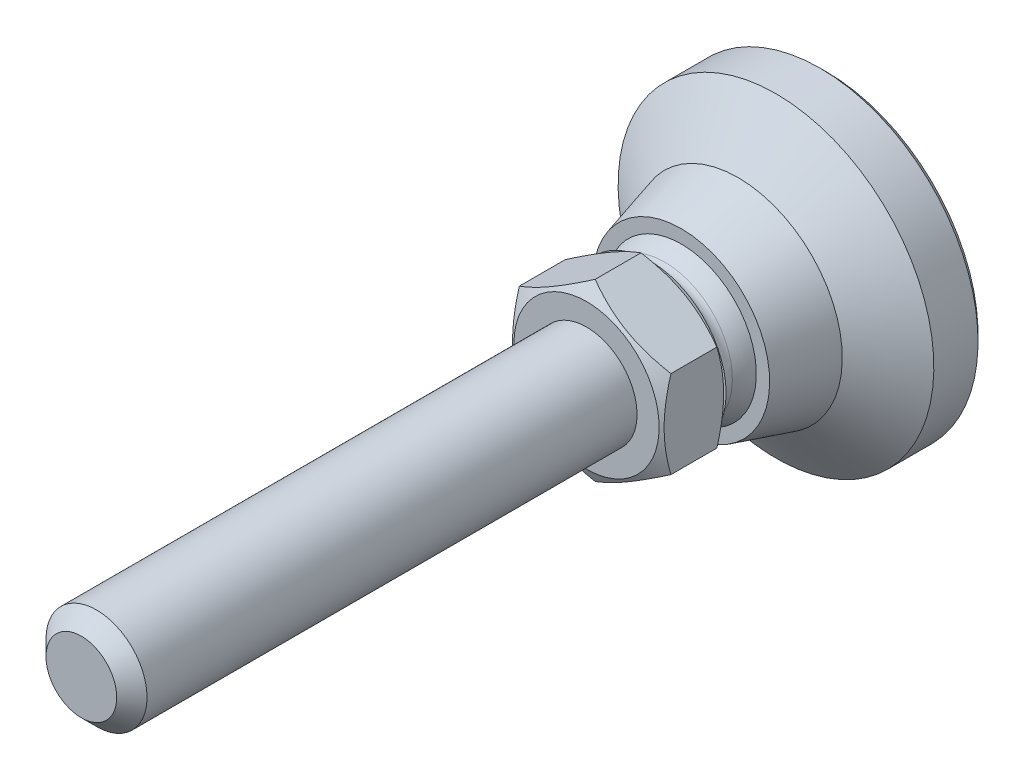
ISO-10303-21;
HEADER;
FILE_DESCRIPTION(('STEP AP214'),'2;1');
FILE_NAME('part.step','',(''),(''),'','','');
FILE_SCHEMA(('AUTOMOTIVE_DESIGN { 1 0 10303 214 1 1 1 1 }'));
ENDSEC;
DATA;
#1=APPLICATION_CONTEXT('core data for automotive mechanical design processes');
#2=APPLICATION_PROTOCOL_DEFINITION('international standard','automotive_design',2000,#1);
#3=PRODUCT_CONTEXT('',#1,'mechanical');
#4=PRODUCT('Part','Part','',(#3));
#5=PRODUCT_RELATED_PRODUCT_CATEGORY('part','',(#4));
#6=PRODUCT_DEFINITION_FORMATION('','',#4);
#7=PRODUCT_DEFINITION_CONTEXT('part definition',#1,'design');
#8=PRODUCT_DEFINITION('design','',#6,#7);
#9=PRODUCT_DEFINITION_SHAPE('','',#8);
#10=(LENGTH_UNIT() NAMED_UNIT(*) SI_UNIT(.MILLI.,.METRE.));
#11=(NAMED_UNIT(*) PLANE_ANGLE_UNIT() SI_UNIT($,.RADIAN.));
#12=(NAMED_UNIT(*) SI_UNIT($,.STERADIAN.) SOLID_ANGLE_UNIT());
#13=UNCERTAINTY_MEASURE_WITH_UNIT(LENGTH_MEASURE(1.E-05),#10,'distance_accuracy_value','');
#14=(GEOMETRIC_REPRESENTATION_CONTEXT(3) GLOBAL_UNCERTAINTY_ASSIGNED_CONTEXT((#13)) GLOBAL_UNIT_ASSIGNED_CONTEXT((#10,
#11,#12)) REPRESENTATION_CONTEXT('',''));
#15=CARTESIAN_POINT('',(0.,0.,0.));
#16=DIRECTION('',(0.,0.,1.));
#17=DIRECTION('',(1.,0.,0.));
#18=AXIS2_PLACEMENT_3D('',#15,#16,#17);
#19=CARTESIAN_POINT('',(0.,0.,13.1997727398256));
#20=DIRECTION('',(0.,0.,-1.));
#21=DIRECTION('',(0.,1.,0.));
#22=AXIS2_PLACEMENT_3D('',#19,#20,#21);
#23=TOROIDAL_SURFACE('',#22,6.05010447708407,0.800227);
#24=CARTESIAN_POINT('',(0.,0.,12.8053527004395));
#25=DIRECTION('',(0.,0.,-1.));
#26=DIRECTION('',(0.,1.,0.));
#27=AXIS2_PLACEMENT_3D('',#24,#25,#26);
#28=CIRCLE('',#27,5.35383148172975);
#29=CARTESIAN_POINT('',(-5.35383148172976,0.,12.8053527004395));
#30=VERTEX_POINT('',#29);
#31=EDGE_CURVE('E163',#30,#30,#28,.T.);
#32=ORIENTED_EDGE('',*,*,#31,.F.);
#33=EDGE_LOOP('',(#32));
#34=FACE_BOUND('',#33,.T.);
#35=CARTESIAN_POINT('',(2.32741435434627,5.58440951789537,13.999999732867));
#36=CARTESIAN_POINT('',(2.3873164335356,5.55944454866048,13.999999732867));
#37=CARTESIAN_POINT('',(2.44681650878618,5.53351506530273,13.999999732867));
#38=CARTESIAN_POINT('',(2.56495174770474,5.47975547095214,13.999999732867));
#39=CARTESIAN_POINT('',(2.62358691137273,5.45192535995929,13.999999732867));
#40=CARTESIAN_POINT('',(2.73993142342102,5.39439291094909,13.999999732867));
#41=CARTESIAN_POINT('',(2.79764077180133,5.36469057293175,13.999999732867));
#42=CARTESIAN_POINT('',(2.91207394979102,5.30344453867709,13.999999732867));
#43=CARTESIAN_POINT('',(2.96879777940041,5.27190084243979,13.999999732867));
#44=CARTESIAN_POINT('',(3.08120116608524,5.20700471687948,13.999999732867));
#45=CARTESIAN_POINT('',(3.1368807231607,5.17365228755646,13.999999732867));
#46=CARTESIAN_POINT('',(3.24713793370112,5.10517326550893,13.999999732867));
#47=CARTESIAN_POINT('',(3.30171558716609,5.07004667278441,13.999999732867));
#48=CARTESIAN_POINT('',(3.409712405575,4.99805559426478,13.999999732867));
#49=CARTESIAN_POINT('',(3.46313157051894,4.96119110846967,13.999999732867));
#50=CARTESIAN_POINT('',(3.56875636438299,4.88576278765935,13.999999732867));
#51=CARTESIAN_POINT('',(3.62096199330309,4.84719895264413,13.999999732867));
#52=CARTESIAN_POINT('',(3.67253333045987,4.80780471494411,13.999999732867));
#53=B_SPLINE_CURVE_WITH_KNOTS('',3,(#35,#36,#37,#38,#39,#40,#41,#42,#43,#44,#45,#46,#47,#48,#49,
#50,#51,#52),.UNSPECIFIED.,.F.,.F.,(4,2,2,2,2,2,2,2,4),(0.,0.194679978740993,0.389359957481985,
0.584039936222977,0.778719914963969,0.973399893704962,1.16807987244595,1.36275985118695,
1.55743982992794),.UNSPECIFIED.);
#54=CARTESIAN_POINT('',(2.32725304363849,5.58454795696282,13.9999997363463));
#55=VERTEX_POINT('',#54);
#56=CARTESIAN_POINT('',(3.67273387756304,4.807734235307,13.9999997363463));
#57=VERTEX_POINT('',#56);
#58=EDGE_CURVE('E109',#55,#57,#53,.T.);
#59=ORIENTED_EDGE('',*,*,#58,.T.);
#60=CARTESIAN_POINT('',(0.,0.,13.999999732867));
#61=DIRECTION('',(0.,0.,-1.));
#62=DIRECTION('',(0.,1.,0.));
#63=AXIS2_PLACEMENT_3D('',#60,#61,#62);
#64=CIRCLE('',#63,6.04999894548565);
#65=CARTESIAN_POINT('',(5.99998692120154,0.776813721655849,13.9999997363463));
#66=VERTEX_POINT('',#65);
#67=EDGE_CURVE('E169',#57,#66,#64,.T.);
#68=ORIENTED_EDGE('',*,*,#67,.T.);
#69=CARTESIAN_POINT('',(5.99994768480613,0.776604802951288,13.999999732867));
#70=CARTESIAN_POINT('',(6.00827842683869,0.712245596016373,13.999999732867));
#71=CARTESIAN_POINT('',(6.01557287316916,0.647752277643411,13.999999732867));
#72=CARTESIAN_POINT('',(6.02808331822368,0.518564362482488,13.999999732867));
#73=CARTESIAN_POINT('',(6.03329931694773,0.453869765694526,13.999999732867));
#74=CARTESIAN_POINT('',(6.04164701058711,0.324346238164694,13.999999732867));
#75=CARTESIAN_POINT('',(6.04477870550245,0.259517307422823,13.999999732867));
#76=CARTESIAN_POINT('',(6.04895467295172,0.129792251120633,13.999999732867));
#77=CARTESIAN_POINT('',(6.04999894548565,0.0648961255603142,13.999999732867));
#78=CARTESIAN_POINT('',(6.04999894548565,-0.0648961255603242,13.999999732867));
#79=CARTESIAN_POINT('',(6.04895467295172,-0.129792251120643,13.999999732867));
#80=CARTESIAN_POINT('',(6.04477870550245,-0.259517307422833,13.999999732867));
#81=CARTESIAN_POINT('',(6.04164701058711,-0.324346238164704,13.999999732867));
#82=CARTESIAN_POINT('',(6.03329931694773,-0.453869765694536,13.999999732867));
#83=CARTESIAN_POINT('',(6.02808331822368,-0.518564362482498,13.999999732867));
#84=CARTESIAN_POINT('',(6.01557287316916,-0.647752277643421,13.999999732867));
#85=CARTESIAN_POINT('',(6.00827842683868,-0.712245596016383,13.999999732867));
#86=CARTESIAN_POINT('',(5.99994768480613,-0.776604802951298,13.999999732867));
#87=B_SPLINE_CURVE_WITH_KNOTS('',3,(#69,#70,#71,#72,#73,#74,#75,#76,#77,#78,#79,#80,#81,#82,#83,
#84,#85,#86),.UNSPECIFIED.,.F.,.F.,(4,2,2,2,2,2,2,2,4),(0.,0.194679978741,0.389359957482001,
0.584039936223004,0.778719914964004,0.973399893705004,1.16807987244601,1.36275985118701,
1.55743982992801),.UNSPECIFIED.);
#88=CARTESIAN_POINT('',(5.99998692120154,-0.776813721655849,13.9999997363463));
#89=VERTEX_POINT('',#88);
#90=EDGE_CURVE('E615',#66,#89,#87,.T.);
#91=ORIENTED_EDGE('',*,*,#90,.T.);
#92=CARTESIAN_POINT('',(3.67273387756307,-4.80773423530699,13.9999997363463));
#93=VERTEX_POINT('',#92);
#94=EDGE_CURVE('E179',#89,#93,#64,.T.);
#95=ORIENTED_EDGE('',*,*,#94,.T.);
#96=CARTESIAN_POINT('',(3.67253333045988,-4.8078047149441,13.999999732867));
#97=CARTESIAN_POINT('',(3.6209619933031,-4.84719895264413,13.999999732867));
#98=CARTESIAN_POINT('',(3.56875636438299,-4.88576278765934,13.999999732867));
#99=CARTESIAN_POINT('',(3.46313157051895,-4.96119110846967,13.999999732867));
#100=CARTESIAN_POINT('',(3.40971240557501,-4.99805559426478,13.999999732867));
#101=CARTESIAN_POINT('',(3.30171558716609,-5.07004667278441,13.999999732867));
#102=CARTESIAN_POINT('',(3.24713793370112,-5.10517326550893,13.999999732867));
#103=CARTESIAN_POINT('',(3.13688072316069,-5.17365228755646,13.999999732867));
#104=CARTESIAN_POINT('',(3.08120116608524,-5.20700471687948,13.999999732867));
#105=CARTESIAN_POINT('',(2.9687977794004,-5.2719008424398,13.999999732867));
#106=CARTESIAN_POINT('',(2.91207394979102,-5.3034445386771,13.999999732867));
#107=CARTESIAN_POINT('',(2.79764077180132,-5.36469057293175,13.999999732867));
#108=CARTESIAN_POINT('',(2.73993142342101,-5.3943929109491,13.999999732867));
#109=CARTESIAN_POINT('',(2.62358691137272,-5.4519253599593,13.999999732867));
#110=CARTESIAN_POINT('',(2.56495174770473,-5.47975547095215,13.999999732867));
#111=CARTESIAN_POINT('',(2.44681650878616,-5.53351506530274,13.999999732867));
#112=CARTESIAN_POINT('',(2.38731643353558,-5.55944454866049,13.999999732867));
#113=CARTESIAN_POINT('',(2.32741435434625,-5.58440951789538,13.999999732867));
#114=B_SPLINE_CURVE_WITH_KNOTS('',3,(#96,#97,#98,#99,#100,#101,#102,#103,#104,#105,#106,#107,
#108,#109,#110,#111,#112,#113),.UNSPECIFIED.,.F.,.F.,(4,2,2,2,2,2,2,2,4),(0.,0.194679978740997,
0.389359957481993,0.584039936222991,0.778719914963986,0.973399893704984,1.16807987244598,
1.36275985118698,1.55743982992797),.UNSPECIFIED.);
#115=CARTESIAN_POINT('',(2.32725304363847,-5.58454795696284,13.9999997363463));
#116=VERTEX_POINT('',#115);
#117=EDGE_CURVE('E262',#93,#116,#114,.T.);
#118=ORIENTED_EDGE('',*,*,#117,.T.);
#119=CARTESIAN_POINT('',(-2.32725304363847,-5.58454795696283,13.9999997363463));
#120=VERTEX_POINT('',#119);
#121=EDGE_CURVE('E181',#116,#120,#64,.T.);
#122=ORIENTED_EDGE('',*,*,#121,.T.);
#123=CARTESIAN_POINT('',(-2.32741435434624,-5.58440951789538,13.999999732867));
#124=CARTESIAN_POINT('',(-2.38731643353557,-5.55944454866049,13.999999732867));
#125=CARTESIAN_POINT('',(-2.44681650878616,-5.53351506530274,13.999999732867));
#126=CARTESIAN_POINT('',(-2.56495174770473,-5.47975547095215,13.999999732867));
#127=CARTESIAN_POINT('',(-2.62358691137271,-5.4519253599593,13.999999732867));
#128=CARTESIAN_POINT('',(-2.73993142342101,-5.3943929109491,13.999999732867));
#129=CARTESIAN_POINT('',(-2.79764077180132,-5.36469057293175,13.999999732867));
#130=CARTESIAN_POINT('',(-2.91207394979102,-5.3034445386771,13.999999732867));
#131=CARTESIAN_POINT('',(-2.9687977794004,-5.2719008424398,13.999999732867));
#132=CARTESIAN_POINT('',(-3.08120116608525,-5.20700471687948,13.999999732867));
#133=CARTESIAN_POINT('',(-3.1368807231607,-5.17365228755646,13.999999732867));
#134=CARTESIAN_POINT('',(-3.24713793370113,-5.10517326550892,13.999999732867));
#135=CARTESIAN_POINT('',(-3.3017155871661,-5.0700466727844,13.999999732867));
#136=CARTESIAN_POINT('',(-3.40971240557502,-4.99805559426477,13.999999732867));
#137=CARTESIAN_POINT('',(-3.46313157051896,-4.96119110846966,13.999999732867));
#138=CARTESIAN_POINT('',(-3.56875636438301,-4.88576278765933,13.999999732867));
#139=CARTESIAN_POINT('',(-3.62096199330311,-4.84719895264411,13.999999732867));
#140=CARTESIAN_POINT('',(-3.67253333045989,-4.80780471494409,13.999999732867));
#141=B_SPLINE_CURVE_WITH_KNOTS('',3,(#123,#124,#125,#126,#127,#128,#129,#130,#131,#132,#133,
#134,#135,#136,#137,#138,#139,#140),.UNSPECIFIED.,.F.,.F.,(4,2,2,2,2,2,2,2,4),(0.,
0.194679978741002,0.389359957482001,0.584039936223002,0.778719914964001,0.973399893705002,
1.168079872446,1.362759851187,1.557439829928),.UNSPECIFIED.);
#142=CARTESIAN_POINT('',(-3.67273387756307,-4.80773423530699,13.9999997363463));
#143=VERTEX_POINT('',#142);
#144=EDGE_CURVE('E148',#120,#143,#141,.T.);
#145=ORIENTED_EDGE('',*,*,#144,.T.);
#146=CARTESIAN_POINT('',(-5.99999019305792,-0.776814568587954,13.9999997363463));
#147=VERTEX_POINT('',#146);
#148=EDGE_CURVE('E183',#143,#147,#64,.T.);
#149=ORIENTED_EDGE('',*,*,#148,.T.);
#150=CARTESIAN_POINT('',(-5.99994768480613,-0.776604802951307,13.999999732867));
#151=CARTESIAN_POINT('',(-6.00827842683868,-0.712245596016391,13.999999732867));
#152=CARTESIAN_POINT('',(-6.01557287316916,-0.647752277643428,13.999999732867));
#153=CARTESIAN_POINT('',(-6.02808331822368,-0.518564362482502,13.999999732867));
#154=CARTESIAN_POINT('',(-6.03329931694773,-0.453869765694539,13.999999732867));
#155=CARTESIAN_POINT('',(-6.04164701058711,-0.324346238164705,13.999999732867));
#156=CARTESIAN_POINT('',(-6.04477870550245,-0.259517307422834,13.999999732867));
#157=CARTESIAN_POINT('',(-6.04895467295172,-0.129792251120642,13.999999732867));
#158=CARTESIAN_POINT('',(-6.04999894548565,-0.0648961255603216,13.999999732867));
#159=CARTESIAN_POINT('',(-6.04999894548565,0.0648961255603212,13.999999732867));
#160=CARTESIAN_POINT('',(-6.04895467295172,0.129792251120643,13.999999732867));
#161=CARTESIAN_POINT('',(-6.04477870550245,0.259517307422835,13.999999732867));
#162=CARTESIAN_POINT('',(-6.04164701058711,0.324346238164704,13.999999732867));
#163=CARTESIAN_POINT('',(-6.03329931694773,0.453869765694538,13.999999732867));
#164=CARTESIAN_POINT('',(-6.02808331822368,0.518564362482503,13.999999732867));
#165=CARTESIAN_POINT('',(-6.01557287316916,0.647752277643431,13.999999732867));
#166=CARTESIAN_POINT('',(-6.00827842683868,0.712245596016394,13.999999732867));
#167=CARTESIAN_POINT('',(-5.99994768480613,0.776604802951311,13.999999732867));
#168=B_SPLINE_CURVE_WITH_KNOTS('',3,(#150,#151,#152,#153,#154,#155,#156,#157,#158,#159,#160,
#161,#162,#163,#164,#165,#166,#167),.UNSPECIFIED.,.F.,.F.,(4,2,2,2,2,2,2,2,4),(0.,
0.194679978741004,0.389359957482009,0.584039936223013,0.778719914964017,0.973399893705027,
1.16807987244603,1.36275985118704,1.55743982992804),.UNSPECIFIED.);
#169=CARTESIAN_POINT('',(-5.99998692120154,0.776813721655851,13.9999997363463));
#170=VERTEX_POINT('',#169);
#171=EDGE_CURVE('E121',#147,#170,#168,.T.);
#172=ORIENTED_EDGE('',*,*,#171,.T.);
#173=CARTESIAN_POINT('',(-3.67273624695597,4.80773664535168,13.9999997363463));
#174=VERTEX_POINT('',#173);
#175=EDGE_CURVE('E185',#170,#174,#64,.T.);
#176=ORIENTED_EDGE('',*,*,#175,.T.);
#177=CARTESIAN_POINT('',(-3.67253333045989,4.80780471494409,13.999999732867));
#178=CARTESIAN_POINT('',(-3.62096199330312,4.84719895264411,13.999999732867));
#179=CARTESIAN_POINT('',(-3.56875636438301,4.88576278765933,13.999999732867));
#180=CARTESIAN_POINT('',(-3.46313157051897,4.96119110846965,13.999999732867));
#181=CARTESIAN_POINT('',(-3.40971240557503,4.99805559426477,13.999999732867));
#182=CARTESIAN_POINT('',(-3.30171558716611,5.0700466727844,13.999999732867));
#183=CARTESIAN_POINT('',(-3.24713793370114,5.10517326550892,13.999999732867));
#184=CARTESIAN_POINT('',(-3.13688072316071,5.17365228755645,13.999999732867));
#185=CARTESIAN_POINT('',(-3.08120116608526,5.20700471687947,13.999999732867));
#186=CARTESIAN_POINT('',(-2.96879777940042,5.27190084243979,13.999999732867));
#187=CARTESIAN_POINT('',(-2.91207394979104,5.30344453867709,13.999999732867));
#188=CARTESIAN_POINT('',(-2.79764077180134,5.36469057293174,13.999999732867));
#189=CARTESIAN_POINT('',(-2.73993142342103,5.39439291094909,13.999999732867));
#190=CARTESIAN_POINT('',(-2.62358691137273,5.45192535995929,13.999999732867));
#191=CARTESIAN_POINT('',(-2.56495174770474,5.47975547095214,13.999999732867));
#192=CARTESIAN_POINT('',(-2.44681650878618,5.53351506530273,13.999999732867));
#193=CARTESIAN_POINT('',(-2.3873164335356,5.55944454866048,13.999999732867));
#194=CARTESIAN_POINT('',(-2.32741435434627,5.58440951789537,13.999999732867));
#195=B_SPLINE_CURVE_WITH_KNOTS('',3,(#177,#178,#179,#180,#181,#182,#183,#184,#185,#186,#187,
#188,#189,#190,#191,#192,#193,#194),.UNSPECIFIED.,.F.,.F.,(4,2,2,2,2,2,2,2,4),(0.,
0.194679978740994,0.389359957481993,0.584039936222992,0.778719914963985,0.973399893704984,
1.16807987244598,1.36275985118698,1.55743982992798),.UNSPECIFIED.);
#196=CARTESIAN_POINT('',(-2.32725304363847,5.58454795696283,13.9999997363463));
#197=VERTEX_POINT('',#196);
#198=EDGE_CURVE('E124',#174,#197,#195,.T.);
#199=ORIENTED_EDGE('',*,*,#198,.T.);
#200=EDGE_CURVE('E166',#197,#55,#64,.T.);
#201=ORIENTED_EDGE('',*,*,#200,.T.);
#202=EDGE_LOOP('',(#59,#68,#91,#95,#118,#122,#145,#149,#172,#176,#199,#201));
#203=FACE_BOUND('',#202,.T.);
#204=ADVANCED_FACE('F14',(#34,#203),#23,.F.);
#205=CARTESIAN_POINT('',(1.25213578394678E-06,0.,9.58060790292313));
#206=DIRECTION('',(0.,0.,-1.));
#207=DIRECTION('',(-1.,0.,0.));
#208=AXIS2_PLACEMENT_3D('',#205,#206,#207);
#209=SPHERICAL_SURFACE('',#208,6.2500003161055);
#210=CARTESIAN_POINT('',(0.,0.,11.5000001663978));
#211=DIRECTION('',(0.,0.,-1.));
#212=DIRECTION('',(0.,1.,0.));
#213=AXIS2_PLACEMENT_3D('',#210,#211,#212);
#214=CIRCLE('',#213,5.94797632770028);
#215=CARTESIAN_POINT('',(-5.94797632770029,0.,11.5000001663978));
#216=VERTEX_POINT('',#215);
#217=EDGE_CURVE('E160',#216,#216,#214,.T.);
#218=CARTESIAN_POINT('',(-5.94797632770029,0.,11.5000001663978));
#219=CARTESIAN_POINT('',(-5.94337818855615,0.,11.5142492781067));
#220=CARTESIAN_POINT('',(-5.93872884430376,0.,11.5284818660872));
#221=CARTESIAN_POINT('',(-5.9293279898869,0.,11.556913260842));
#222=CARTESIAN_POINT('',(-5.92457647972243,0.,11.5711120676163));
#223=CARTESIAN_POINT('',(-5.91497153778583,0.,11.5994751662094));
#224=CARTESIAN_POINT('',(-5.91011810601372,0.,11.6136394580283));
#225=CARTESIAN_POINT('',(-5.90030957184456,0.,11.6419327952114));
#226=CARTESIAN_POINT('',(-5.89535446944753,0.,11.6560618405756));
#227=CARTESIAN_POINT('',(-5.88534284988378,0.,11.6842839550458));
#228=CARTESIAN_POINT('',(-5.88028633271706,0.,11.6983770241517));
#229=CARTESIAN_POINT('',(-5.87007214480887,0.,11.7265264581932));
#230=CARTESIAN_POINT('',(-5.86491447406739,0.,11.7405828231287));
#231=CARTESIAN_POINT('',(-5.85449824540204,0.,11.768658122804));
#232=CARTESIAN_POINT('',(-5.84923968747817,0.,11.7826770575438));
#233=CARTESIAN_POINT('',(-5.83862195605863,0.,11.8106767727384));
#234=CARTESIAN_POINT('',(-5.83326278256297,0.,11.824657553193));
#235=CARTESIAN_POINT('',(-5.82244409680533,0.,11.8525802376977));
#236=CARTESIAN_POINT('',(-5.81698458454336,0.,11.8665221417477));
#237=CARTESIAN_POINT('',(-5.80596550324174,0.,11.8943663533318));
#238=CARTESIAN_POINT('',(-5.80040593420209,0.,11.9082686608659));
#239=CARTESIAN_POINT('',(-5.7891870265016,0.,11.9360329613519));
#240=CARTESIAN_POINT('',(-5.78352768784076,0.,11.9498949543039));
#241=CARTESIAN_POINT('',(-5.77210953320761,0.,11.9775779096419));
#242=CARTESIAN_POINT('',(-5.7663507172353,0.,11.9913988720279));
#243=CARTESIAN_POINT('',(-5.754733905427,0.,12.0189990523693));
#244=CARTESIAN_POINT('',(-5.74887590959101,0.,12.0327782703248));
#245=CARTESIAN_POINT('',(-5.73706104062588,0.,12.0602942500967));
#246=CARTESIAN_POINT('',(-5.73110416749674,0.,12.0740310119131));
#247=CARTESIAN_POINT('',(-5.71909185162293,0.,12.1014613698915));
#248=CARTESIAN_POINT('',(-5.71303640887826,0.,12.1151549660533));
#249=CARTESIAN_POINT('',(-5.70082726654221,0.,12.1424982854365));
#250=CARTESIAN_POINT('',(-5.69467356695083,0.,12.1561480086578));
#251=CARTESIAN_POINT('',(-5.68226822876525,0.,12.1834028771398));
#252=CARTESIAN_POINT('',(-5.67601659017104,0.,12.1970080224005));
#253=CARTESIAN_POINT('',(-5.66341569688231,0.,12.224173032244));
#254=CARTESIAN_POINT('',(-5.65706644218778,0.,12.2377328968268));
#255=CARTESIAN_POINT('',(-5.64427064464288,0.,12.2648066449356));
#256=CARTESIAN_POINT('',(-5.6378241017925,0.,12.2783205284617));
#257=CARTESIAN_POINT('',(-5.62483406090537,0.,12.3053016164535));
#258=CARTESIAN_POINT('',(-5.61829056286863,0.,12.3187688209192));
#259=CARTESIAN_POINT('',(-5.60510694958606,0.,12.3456558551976));
#260=CARTESIAN_POINT('',(-5.59846683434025,0.,12.3590756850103));
#261=CARTESIAN_POINT('',(-5.58509032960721,0.,12.3858672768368));
#262=CARTESIAN_POINT('',(-5.57835394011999,0.,12.3992390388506));
#263=CARTESIAN_POINT('',(-5.56478523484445,0.,12.4259338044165));
#264=CARTESIAN_POINT('',(-5.55795291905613,0.,12.4392568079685));
#265=CARTESIAN_POINT('',(-5.54419271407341,0.,12.4658533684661));
#266=CARTESIAN_POINT('',(-5.53726482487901,0.,12.4791269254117));
#267=CARTESIAN_POINT('',(-5.52331383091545,0.,12.5056239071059));
#268=CARTESIAN_POINT('',(-5.51629072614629,0.,12.5188473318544));
#269=CARTESIAN_POINT('',(-5.50214966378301,0.,12.5452433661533));
#270=CARTESIAN_POINT('',(-5.49503170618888,0.,12.5584159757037));
#271=CARTESIAN_POINT('',(-5.48070130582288,0.,12.5847096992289));
#272=CARTESIAN_POINT('',(-5.47348886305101,0.,12.5978308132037));
#273=CARTESIAN_POINT('',(-5.45896986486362,0.,12.624020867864));
#274=CARTESIAN_POINT('',(-5.45166330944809,0.,12.6370898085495));
#275=CARTESIAN_POINT('',(-5.43695646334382,0.,12.6631748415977));
#276=CARTESIAN_POINT('',(-5.42955617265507,0.,12.6761909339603));
#277=CARTESIAN_POINT('',(-5.41466223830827,0.,12.7021695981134));
#278=CARTESIAN_POINT('',(-5.40716859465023,0.,12.7151321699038));
#279=CARTESIAN_POINT('',(-5.39208834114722,0.,12.7410031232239));
#280=CARTESIAN_POINT('',(-5.38450173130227,0.,12.7539115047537));
#281=CARTESIAN_POINT('',(-5.36923593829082,0.,12.7796734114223));
#282=CARTESIAN_POINT('',(-5.36155675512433,0.,12.7925269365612));
#283=CARTESIAN_POINT('',(-5.35383148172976,0.,12.8053527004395));
#284=B_SPLINE_CURVE_WITH_KNOTS('',3,(#218,#219,#220,#221,#222,#223,#224,#225,#226,#227,#228,
#229,#230,#231,#232,#233,#234,#235,#236,#237,#238,#239,#240,#241,#242,#243,#244,#245,#246,#247,
#248,#249,#250,#251,#252,#253,#254,#255,#256,#257,#258,#259,#260,#261,#262,#263,#264,#265,#266,
#267,#268,#269,#270,#271,#272,#273,#274,#275,#276,#277,#278,#279,#280,#281,#282,#283),
.UNSPECIFIED.,.F.,.F.,(4,2,2,2,2,2,2,2,2,2,2,2,2,2,2,2,2,2,2,2,2,2,2,2,2,2,2,2,2,2,2,2,4),(0.,
0.0449178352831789,0.0898356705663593,0.13475350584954,0.17967134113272,0.2245891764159,
0.269507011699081,0.314424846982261,0.35934268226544,0.404260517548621,0.449178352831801,
0.494096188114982,0.539014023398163,0.583931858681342,0.628849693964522,0.673767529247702,
0.718685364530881,0.763603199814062,0.808521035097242,0.853438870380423,0.898356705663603,
0.943274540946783,0.988192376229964,1.03311021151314,1.07802804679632,1.1229458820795,
1.16786371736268,1.21278155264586,1.25769938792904,1.30261722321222,1.34753505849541,
1.39245289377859,1.43737072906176),.UNSPECIFIED.);
#285=EDGE_CURVE('BSEAM280',#216,#30,#284,.T.);
#286=ORIENTED_EDGE('',*,*,#217,.F.);
#287=ORIENTED_EDGE('',*,*,#31,.T.);
#288=ORIENTED_EDGE('',*,*,#285,.T.);
#289=ORIENTED_EDGE('',*,*,#285,.F.);
#290=EDGE_LOOP('',(#286,#288,#287,#289));
#291=FACE_BOUND('',#290,.T.);
#292=ADVANCED_FACE('F280',(#291),#209,.T.);
#293=CARTESIAN_POINT('',(-6.34999904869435,0.,11.5));
#294=DIRECTION('',(0.,0.,-1.));
#295=DIRECTION('',(0.,1.,0.));
#296=AXIS2_PLACEMENT_3D('',#293,#294,#295);
#297=PLANE('',#296);
#298=CARTESIAN_POINT('',(0.,0.,11.5));
#299=DIRECTION('',(0.,0.,-1.));
#300=DIRECTION('',(0.,1.,0.));
#301=AXIS2_PLACEMENT_3D('',#298,#299,#300);
#302=CIRCLE('',#301,6.99999904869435);
#303=CARTESIAN_POINT('',(0.,6.99999904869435,11.5));
#304=VERTEX_POINT('',#303);
#305=EDGE_CURVE('E157',#304,#304,#302,.T.);
#306=ORIENTED_EDGE('',*,*,#305,.F.);
#307=EDGE_LOOP('',(#306));
#308=FACE_BOUND('',#307,.T.);
#309=ORIENTED_EDGE('',*,*,#217,.T.);
#310=EDGE_LOOP('',(#309));
#311=FACE_BOUND('',#310,.T.);
#312=ADVANCED_FACE('F565',(#308,#311),#297,.F.);
#313=CARTESIAN_POINT('',(0.,0.,11.5));
#314=DIRECTION('',(0.,0.,-1.));
#315=DIRECTION('',(0.,1.,0.));
#316=AXIS2_PLACEMENT_3D('',#313,#314,#315);
#317=CONICAL_SURFACE('',#316,6.99999904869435,0.270946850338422);
#318=CARTESIAN_POINT('',(0.,0.,7.));
#319=DIRECTION('',(0.,0.,-1.));
#320=DIRECTION('',(0.,1.,0.));
#321=AXIS2_PLACEMENT_3D('',#318,#319,#320);
#322=CIRCLE('',#321,8.24999904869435);
#323=CARTESIAN_POINT('',(0.,8.24999904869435,7.));
#324=VERTEX_POINT('',#323);
#325=EDGE_CURVE('E154',#324,#324,#322,.T.);
#326=ORIENTED_EDGE('',*,*,#325,.F.);
#327=EDGE_LOOP('',(#326));
#328=FACE_BOUND('',#327,.T.);
#329=ORIENTED_EDGE('',*,*,#305,.T.);
#330=EDGE_LOOP('',(#329));
#331=FACE_BOUND('',#330,.T.);
#332=ADVANCED_FACE('F555',(#328,#331),#317,.T.);
#333=CARTESIAN_POINT('',(0.,0.,7.));
#334=DIRECTION('',(0.,0.,-1.));
#335=DIRECTION('',(0.,1.,0.));
#336=AXIS2_PLACEMENT_3D('',#333,#334,#335);
#337=CONICAL_SURFACE('',#336,8.24999904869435,0.956133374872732);
#338=CARTESIAN_POINT('',(0.,0.,4.));
#339=DIRECTION('',(0.,0.,-1.));
#340=DIRECTION('',(0.,1.,0.));
#341=AXIS2_PLACEMENT_3D('',#338,#339,#340);
#342=CIRCLE('',#341,12.4999990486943);
#343=CARTESIAN_POINT('',(0.,12.4999990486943,4.));
#344=VERTEX_POINT('',#343);
#345=EDGE_CURVE('E151',#344,#344,#342,.T.);
#346=ORIENTED_EDGE('',*,*,#345,.F.);
#347=EDGE_LOOP('',(#346));
#348=FACE_BOUND('',#347,.T.);
#349=ORIENTED_EDGE('',*,*,#325,.T.);
#350=EDGE_LOOP('',(#349));
#351=FACE_BOUND('',#350,.T.);
#352=ADVANCED_FACE('F545',(#348,#351),#337,.T.);
#353=CARTESIAN_POINT('',(0.,0.,0.));
#354=DIRECTION('',(0.,0.,-1.));
#355=DIRECTION('',(0.,1.,0.));
#356=AXIS2_PLACEMENT_3D('',#353,#354,#355);
#357=CYLINDRICAL_SURFACE('',#356,12.4999990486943);
#358=CARTESIAN_POINT('',(0.,0.,0.5));
#359=DIRECTION('',(0.,0.,-1.));
#360=DIRECTION('',(0.,1.,0.));
#361=AXIS2_PLACEMENT_3D('',#358,#359,#360);
#362=CIRCLE('',#361,12.4999990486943);
#363=CARTESIAN_POINT('',(0.,12.4999990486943,0.5));
#364=VERTEX_POINT('',#363);
#365=EDGE_CURVE('E147',#364,#364,#362,.T.);
#366=ORIENTED_EDGE('',*,*,#365,.F.);
#367=EDGE_LOOP('',(#366));
#368=FACE_BOUND('',#367,.T.);
#369=ORIENTED_EDGE('',*,*,#345,.T.);
#370=EDGE_LOOP('',(#369));
#371=FACE_BOUND('',#370,.T.);
#372=ADVANCED_FACE('F536',(#368,#371),#357,.T.);
#373=CARTESIAN_POINT('',(0.,0.,0.5));
#374=DIRECTION('',(0.,0.,1.));
#375=DIRECTION('',(0.,-1.,0.));
#376=AXIS2_PLACEMENT_3D('',#373,#374,#375);
#377=CONICAL_SURFACE('',#376,12.4999990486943,0.785398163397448);
#378=CARTESIAN_POINT('',(0.,0.,0.));
#379=DIRECTION('',(0.,0.,-1.));
#380=DIRECTION('',(0.,1.,0.));
#381=AXIS2_PLACEMENT_3D('',#378,#379,#380);
#382=CIRCLE('',#381,11.9999990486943);
#383=CARTESIAN_POINT('',(0.,11.9999990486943,0.));
#384=VERTEX_POINT('',#383);
#385=EDGE_CURVE('E144',#384,#384,#382,.T.);
#386=ORIENTED_EDGE('',*,*,#385,.F.);
#387=EDGE_LOOP('',(#386));
#388=FACE_BOUND('',#387,.T.);
#389=ORIENTED_EDGE('',*,*,#365,.T.);
#390=EDGE_LOOP('',(#389));
#391=FACE_BOUND('',#390,.T.);
#392=ADVANCED_FACE('F527',(#388,#391),#377,.T.);
#393=CARTESIAN_POINT('',(0.,0.,0.));
#394=DIRECTION('',(0.,0.,1.));
#395=DIRECTION('',(0.,-1.,0.));
#396=AXIS2_PLACEMENT_3D('',#393,#394,#395);
#397=PLANE('',#396);
#398=ORIENTED_EDGE('',*,*,#385,.T.);
#399=EDGE_LOOP('',(#398));
#400=FACE_BOUND('',#399,.T.);
#401=ADVANCED_FACE('F218',(#400),#397,.F.);
#402=CARTESIAN_POINT('',(0.,5.75,13.9999997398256));
#403=DIRECTION('',(0.,0.,-1.));
#404=DIRECTION('',(-1.,0.,0.));
#405=AXIS2_PLACEMENT_3D('',#402,#403,#404);
#406=PLANE('',#405);
#407=ORIENTED_EDGE('',*,*,#144,.F.);
#408=ORIENTED_EDGE('',*,*,#121,.F.);
#409=ORIENTED_EDGE('',*,*,#117,.F.);
#410=ORIENTED_EDGE('',*,*,#94,.F.);
#411=ORIENTED_EDGE('',*,*,#90,.F.);
#412=ORIENTED_EDGE('',*,*,#67,.F.);
#413=ORIENTED_EDGE('',*,*,#58,.F.);
#414=ORIENTED_EDGE('',*,*,#200,.F.);
#415=ORIENTED_EDGE('',*,*,#198,.F.);
#416=ORIENTED_EDGE('',*,*,#175,.F.);
#417=ORIENTED_EDGE('',*,*,#171,.F.);
#418=ORIENTED_EDGE('',*,*,#148,.F.);
#419=EDGE_LOOP('',(#407,#408,#409,#410,#411,#412,#413,#414,#415,#416,#417,#418));
#420=FACE_BOUND('',#419,.T.);
#421=CARTESIAN_POINT('',(0.,0.,13.9999997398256));
#422=DIRECTION('',(0.,0.,-1.));
#423=DIRECTION('',(-1.,0.,0.));
#424=AXIS2_PLACEMENT_3D('',#421,#422,#423);
#425=CIRCLE('',#424,5.75);
#426=CARTESIAN_POINT('',(-5.75,0.,13.9999997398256));
#427=VERTEX_POINT('',#426);
#428=EDGE_CURVE('E115',#427,#427,#425,.T.);
#429=ORIENTED_EDGE('',*,*,#428,.T.);
#430=EDGE_LOOP('',(#429));
#431=FACE_BOUND('',#430,.T.);
#432=ADVANCED_FACE('F194',(#420,#431),#406,.F.);
#433=CARTESIAN_POINT('',(0.,0.,15.3379732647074));
#434=DIRECTION('',(0.,0.,1.));
#435=DIRECTION('',(1.,0.,0.));
#436=AXIS2_PLACEMENT_3D('',#433,#434,#435);
#437=CONICAL_SURFACE('',#436,8.06743812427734,1.0471975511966);
#438=CARTESIAN_POINT('',(-6.0002,3.46398614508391,14.6803023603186));
#439=CARTESIAN_POINT('',(-5.86831298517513,3.54013114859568,14.6363463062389));
#440=CARTESIAN_POINT('',(-5.73593423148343,3.61656005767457,14.5943851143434));
#441=CARTESIAN_POINT('',(-5.47010166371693,3.77003856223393,14.5150018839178));
#442=CARTESIAN_POINT('',(-5.3366474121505,3.84708841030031,14.4775818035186));
#443=CARTESIAN_POINT('',(-4.93414786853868,4.07947163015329,14.3728677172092));
#444=CARTESIAN_POINT('',(-4.66351376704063,4.23572230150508,14.3133073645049));
#445=CARTESIAN_POINT('',(-4.25851475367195,4.46954859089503,14.2434655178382));
#446=CARTESIAN_POINT('',(-4.12535995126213,4.54642555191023,14.2235695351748));
#447=CARTESIAN_POINT('',(-3.85844867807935,4.70052684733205,14.190206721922));
#448=CARTESIAN_POINT('',(-3.72469226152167,4.77775115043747,14.1767393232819));
#449=CARTESIAN_POINT('',(-3.45694711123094,4.93233388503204,14.1565768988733));
#450=CARTESIAN_POINT('',(-3.32295881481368,5.0096920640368,14.1498741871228));
#451=CARTESIAN_POINT('',(-3.05486583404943,5.16447561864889,14.1433776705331));
#452=CARTESIAN_POINT('',(-2.92076115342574,5.24190099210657,14.1435836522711));
#453=CARTESIAN_POINT('',(-2.55335498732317,5.45402304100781,14.1536444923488));
#454=CARTESIAN_POINT('',(-2.3201737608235,5.58865028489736,14.1705352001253));
#455=CARTESIAN_POINT('',(-1.85536008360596,5.85701058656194,14.2240965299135));
#456=CARTESIAN_POINT('',(-1.6237292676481,5.99074270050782,14.2607854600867));
#457=CARTESIAN_POINT('',(-1.15798010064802,6.25964310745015,14.3524974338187));
#458=CARTESIAN_POINT('',(-0.923920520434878,6.39477746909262,14.4079090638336));
#459=CARTESIAN_POINT('',(-0.459291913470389,6.66303092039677,14.5336712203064));
#460=CARTESIAN_POINT('',(-0.228716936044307,6.79615344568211,14.6039922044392));
#461=CARTESIAN_POINT('',(0.000200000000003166,6.92831870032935,14.6803023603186));
#462=B_SPLINE_CURVE_WITH_KNOTS('',3,(#438,#439,#440,#441,#442,#443,#444,#445,#446,#447,#448,
#449,#450,#451,#452,#453,#454,#455,#456,#457,#458,#459,#460,#461),.UNSPECIFIED.,.F.,.F.,(4,2,2,
2,2,2,2,2,2,2,2,4),(0.,0.475482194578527,0.95116869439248,1.90451835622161,2.36951738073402,
2.83447530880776,3.29890435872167,3.76331906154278,4.57182194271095,5.38107376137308,
6.20827406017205,7.03385036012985),.UNSPECIFIED.);
#463=CARTESIAN_POINT('',(-6.,3.46410161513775,14.6802356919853));
#464=VERTEX_POINT('',#463);
#465=CARTESIAN_POINT('',(0.,6.92820323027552,14.6802356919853));
#466=VERTEX_POINT('',#465);
#467=EDGE_CURVE('E29',#464,#466,#462,.T.);
#468=ORIENTED_EDGE('',*,*,#467,.T.);
#469=CARTESIAN_POINT('',(-0.000199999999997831,6.92831870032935,14.6803023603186));
#470=CARTESIAN_POINT('',(0.131687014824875,6.85217369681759,14.6363463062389));
#471=CARTESIAN_POINT('',(0.264065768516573,6.7757447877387,14.5943851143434));
#472=CARTESIAN_POINT('',(0.529898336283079,6.62226628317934,14.5150018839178));
#473=CARTESIAN_POINT('',(0.663352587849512,6.54521643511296,14.4775818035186));
#474=CARTESIAN_POINT('',(1.06585213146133,6.31283321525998,14.3728677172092));
#475=CARTESIAN_POINT('',(1.33648623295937,6.15658254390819,14.3133073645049));
#476=CARTESIAN_POINT('',(1.74148524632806,5.92275625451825,14.2434655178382));
#477=CARTESIAN_POINT('',(1.87464004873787,5.84587929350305,14.2235695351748));
#478=CARTESIAN_POINT('',(2.14155132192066,5.69177799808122,14.190206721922));
#479=CARTESIAN_POINT('',(2.27530773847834,5.61455369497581,14.1767393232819));
#480=CARTESIAN_POINT('',(2.54305288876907,5.45997096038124,14.1565768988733));
#481=CARTESIAN_POINT('',(2.67704118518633,5.38261278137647,14.1498741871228));
#482=CARTESIAN_POINT('',(2.94513416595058,5.22782922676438,14.1433776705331));
#483=CARTESIAN_POINT('',(3.07923884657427,5.15040385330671,14.1435836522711));
#484=CARTESIAN_POINT('',(3.44664501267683,4.93828180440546,14.1536444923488));
#485=CARTESIAN_POINT('',(3.67982623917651,4.80365456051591,14.1705352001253));
#486=CARTESIAN_POINT('',(4.14463991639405,4.53529425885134,14.2240965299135));
#487=CARTESIAN_POINT('',(4.37627073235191,4.40156214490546,14.2607854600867));
#488=CARTESIAN_POINT('',(4.84201989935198,4.13266173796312,14.3524974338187));
#489=CARTESIAN_POINT('',(5.07607947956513,3.99752737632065,14.4079090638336));
#490=CARTESIAN_POINT('',(5.54070808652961,3.72927392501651,14.5336712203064));
#491=CARTESIAN_POINT('',(5.77128306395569,3.59615139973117,14.6039922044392));
#492=CARTESIAN_POINT('',(6.0002,3.46398614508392,14.6803023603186));
#493=B_SPLINE_CURVE_WITH_KNOTS('',3,(#469,#470,#471,#472,#473,#474,#475,#476,#477,#478,#479,
#480,#481,#482,#483,#484,#485,#486,#487,#488,#489,#490,#491,#492),.UNSPECIFIED.,.F.,.F.,(4,2,2,
2,2,2,2,2,2,2,2,4),(0.,0.475482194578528,0.951168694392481,1.90451835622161,2.36951738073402,
2.83447530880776,3.29890435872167,3.76331906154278,4.57182194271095,5.38107376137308,
6.20827406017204,7.03385036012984),.UNSPECIFIED.);
#494=CARTESIAN_POINT('',(6.,3.46410161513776,14.6802356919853));
#495=VERTEX_POINT('',#494);
#496=EDGE_CURVE('E102',#466,#495,#493,.T.);
#497=ORIENTED_EDGE('',*,*,#496,.T.);
#498=CARTESIAN_POINT('',(6.,3.46430161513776,14.6802934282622));
#499=CARTESIAN_POINT('',(6.,3.31201186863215,14.6363377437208));
#500=CARTESIAN_POINT('',(6.,3.15915431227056,14.5943769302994));
#501=CARTESIAN_POINT('',(6.,2.8521978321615,14.5149944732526));
#502=CARTESIAN_POINT('',(6.,2.69809840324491,14.4775747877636));
#503=CARTESIAN_POINT('',(6.,2.23333279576,14.372861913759));
#504=CARTESIAN_POINT('',(6.,1.92083203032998,14.3133023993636));
#505=CARTESIAN_POINT('',(6.,1.45318032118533,14.2434618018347));
#506=CARTESIAN_POINT('',(6.,1.29942666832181,14.223566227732));
#507=CARTESIAN_POINT('',(6.,0.991224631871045,14.1902042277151));
#508=CARTESIAN_POINT('',(6.,0.836776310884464,14.1767372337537));
#509=CARTESIAN_POINT('',(6.,0.527611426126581,14.1565756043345));
#510=CARTESIAN_POINT('',(6.,0.372895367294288,14.1498732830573));
#511=CARTESIAN_POINT('',(6.,0.0633288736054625,14.1433775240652));
#512=CARTESIAN_POINT('',(6.,-0.091521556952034,14.1435838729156));
#513=CARTESIAN_POINT('',(6.,-0.515760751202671,14.1536455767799));
#514=CARTESIAN_POINT('',(6.,-0.785010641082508,14.1705364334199));
#515=CARTESIAN_POINT('',(6.,-1.3217220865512,14.2240973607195));
#516=CARTESIAN_POINT('',(6.,-1.58918175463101,14.2607857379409));
#517=CARTESIAN_POINT('',(6.,-2.12697331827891,14.3524959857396));
#518=CARTESIAN_POINT('',(6.,-2.39723735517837,14.4079064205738));
#519=CARTESIAN_POINT('',(6.,-2.93373504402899,14.5336657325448));
#520=CARTESIAN_POINT('',(6.,-3.19997556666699,14.6039850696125));
#521=CARTESIAN_POINT('',(6.,-3.46430161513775,14.6802934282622));
#522=B_SPLINE_CURVE_WITH_KNOTS('',3,(#498,#499,#500,#501,#502,#503,#504,#505,#506,#507,#508,
#509,#510,#511,#512,#513,#514,#515,#516,#517,#518,#519,#520,#521),.UNSPECIFIED.,.F.,.F.,(4,2,2,
2,2,2,2,2,2,2,2,4),(0.,0.475481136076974,0.951166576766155,1.9045140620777,2.36951212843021,
2.8344690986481,3.29889720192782,3.76331095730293,4.57180014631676,5.38103822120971,
6.20822404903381,7.03378598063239),.UNSPECIFIED.);
#523=CARTESIAN_POINT('',(6.,-3.46410161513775,14.6802356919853));
#524=VERTEX_POINT('',#523);
#525=EDGE_CURVE('E105',#495,#524,#522,.T.);
#526=ORIENTED_EDGE('',*,*,#525,.T.);
#527=CARTESIAN_POINT('',(6.0002,-3.46398614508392,14.6803023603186));
#528=CARTESIAN_POINT('',(5.86831298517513,-3.54013114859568,14.6363463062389));
#529=CARTESIAN_POINT('',(5.73593423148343,-3.61656005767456,14.5943851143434));
#530=CARTESIAN_POINT('',(5.47010166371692,-3.77003856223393,14.5150018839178));
#531=CARTESIAN_POINT('',(5.33664741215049,-3.84708841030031,14.4775818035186));
#532=CARTESIAN_POINT('',(4.93414786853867,-4.07947163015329,14.3728677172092));
#533=CARTESIAN_POINT('',(4.66351376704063,-4.23572230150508,14.3133073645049));
#534=CARTESIAN_POINT('',(4.25851475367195,-4.46954859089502,14.2434655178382));
#535=CARTESIAN_POINT('',(4.12535995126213,-4.54642555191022,14.2235695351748));
#536=CARTESIAN_POINT('',(3.85844867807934,-4.70052684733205,14.1902067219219));
#537=CARTESIAN_POINT('',(3.72469226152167,-4.77775115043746,14.1767393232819));
#538=CARTESIAN_POINT('',(3.45694711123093,-4.93233388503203,14.1565768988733));
#539=CARTESIAN_POINT('',(3.32295881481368,-5.00969206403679,14.1498741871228));
#540=CARTESIAN_POINT('',(3.05486583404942,-5.16447561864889,14.1433776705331));
#541=CARTESIAN_POINT('',(2.92076115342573,-5.24190099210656,14.1435836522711));
#542=CARTESIAN_POINT('',(2.55335498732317,-5.45402304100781,14.1536444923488));
#543=CARTESIAN_POINT('',(2.3201737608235,-5.58865028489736,14.1705352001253));
#544=CARTESIAN_POINT('',(1.85536008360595,-5.85701058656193,14.2240965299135));
#545=CARTESIAN_POINT('',(1.62372926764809,-5.99074270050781,14.2607854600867));
#546=CARTESIAN_POINT('',(1.15798010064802,-6.25964310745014,14.3524974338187));
#547=CARTESIAN_POINT('',(0.923920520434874,-6.39477746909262,14.4079090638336));
#548=CARTESIAN_POINT('',(0.459291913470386,-6.66303092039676,14.5336712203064));
#549=CARTESIAN_POINT('',(0.228716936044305,-6.7961534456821,14.6039922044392));
#550=CARTESIAN_POINT('',(-0.000200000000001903,-6.92831870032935,14.6803023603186));
#551=B_SPLINE_CURVE_WITH_KNOTS('',3,(#527,#528,#529,#530,#531,#532,#533,#534,#535,#536,#537,
#538,#539,#540,#541,#542,#543,#544,#545,#546,#547,#548,#549,#550),.UNSPECIFIED.,.F.,.F.,(4,2,2,
2,2,2,2,2,2,2,2,4),(0.,0.475482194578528,0.951168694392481,1.90451835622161,2.36951738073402,
2.83447530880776,3.29890435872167,3.76331906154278,4.57182194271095,5.38107376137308,
6.20827406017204,7.03385036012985),.UNSPECIFIED.);
#552=CARTESIAN_POINT('',(0.,-6.92820323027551,14.6802356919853));
#553=VERTEX_POINT('',#552);
#554=EDGE_CURVE('E114',#524,#553,#551,.T.);
#555=ORIENTED_EDGE('',*,*,#554,.T.);
#556=CARTESIAN_POINT('',(0.000199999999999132,-6.92831870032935,14.6803023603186));
#557=CARTESIAN_POINT('',(-0.131687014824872,-6.85217369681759,14.6363463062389));
#558=CARTESIAN_POINT('',(-0.26406576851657,-6.7757447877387,14.5943851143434));
#559=CARTESIAN_POINT('',(-0.529898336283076,-6.62226628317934,14.5150018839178));
#560=CARTESIAN_POINT('',(-0.663352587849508,-6.54521643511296,14.4775818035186));
#561=CARTESIAN_POINT('',(-1.06585213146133,-6.31283321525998,14.3728677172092));
#562=CARTESIAN_POINT('',(-1.33648623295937,-6.15658254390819,14.3133073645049));
#563=CARTESIAN_POINT('',(-1.74148524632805,-5.92275625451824,14.2434655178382));
#564=CARTESIAN_POINT('',(-1.87464004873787,-5.84587929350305,14.2235695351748));
#565=CARTESIAN_POINT('',(-2.14155132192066,-5.69177799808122,14.1902067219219));
#566=CARTESIAN_POINT('',(-2.27530773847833,-5.6145536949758,14.1767393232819));
#567=CARTESIAN_POINT('',(-2.54305288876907,-5.45997096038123,14.1565768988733));
#568=CARTESIAN_POINT('',(-2.67704118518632,-5.38261278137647,14.1498741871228));
#569=CARTESIAN_POINT('',(-2.94513416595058,-5.22782922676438,14.1433776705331));
#570=CARTESIAN_POINT('',(-3.07923884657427,-5.15040385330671,14.1435836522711));
#571=CARTESIAN_POINT('',(-3.44664501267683,-4.93828180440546,14.1536444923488));
#572=CARTESIAN_POINT('',(-3.6798262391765,-4.80365456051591,14.1705352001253));
#573=CARTESIAN_POINT('',(-4.14463991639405,-4.53529425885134,14.2240965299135));
#574=CARTESIAN_POINT('',(-4.3762707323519,-4.40156214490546,14.2607854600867));
#575=CARTESIAN_POINT('',(-4.84201989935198,-4.13266173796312,14.3524974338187));
#576=CARTESIAN_POINT('',(-5.07607947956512,-3.99752737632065,14.4079090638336));
#577=CARTESIAN_POINT('',(-5.54070808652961,-3.7292739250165,14.5336712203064));
#578=CARTESIAN_POINT('',(-5.77128306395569,-3.59615139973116,14.6039922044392));
#579=CARTESIAN_POINT('',(-6.0002,-3.46398614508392,14.6803023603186));
#580=B_SPLINE_CURVE_WITH_KNOTS('',3,(#556,#557,#558,#559,#560,#561,#562,#563,#564,#565,#566,
#567,#568,#569,#570,#571,#572,#573,#574,#575,#576,#577,#578,#579),.UNSPECIFIED.,.F.,.F.,(4,2,2,
2,2,2,2,2,2,2,2,4),(0.,0.475482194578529,0.951168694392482,1.90451835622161,2.36951738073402,
2.83447530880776,3.29890435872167,3.76331906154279,4.57182194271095,5.38107376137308,
6.20827406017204,7.03385036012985),.UNSPECIFIED.);
#581=CARTESIAN_POINT('',(-6.,-3.46410161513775,14.6802356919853));
#582=VERTEX_POINT('',#581);
#583=EDGE_CURVE('E363',#553,#582,#580,.T.);
#584=ORIENTED_EDGE('',*,*,#583,.T.);
#585=CARTESIAN_POINT('',(-6.,-3.46430161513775,14.6802934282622));
#586=CARTESIAN_POINT('',(-6.,-3.31201186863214,14.6363377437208));
#587=CARTESIAN_POINT('',(-6.,-3.15915431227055,14.5943769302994));
#588=CARTESIAN_POINT('',(-6.,-2.8521978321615,14.5149944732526));
#589=CARTESIAN_POINT('',(-6.,-2.6980984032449,14.4775747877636));
#590=CARTESIAN_POINT('',(-6.,-2.23333279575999,14.372861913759));
#591=CARTESIAN_POINT('',(-6.,-1.92083203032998,14.3133023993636));
#592=CARTESIAN_POINT('',(-6.,-1.45318032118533,14.2434618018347));
#593=CARTESIAN_POINT('',(-6.,-1.29942666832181,14.223566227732));
#594=CARTESIAN_POINT('',(-6.,-0.991224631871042,14.1902042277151));
#595=CARTESIAN_POINT('',(-6.,-0.836776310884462,14.1767372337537));
#596=CARTESIAN_POINT('',(-6.,-0.527611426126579,14.1565756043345));
#597=CARTESIAN_POINT('',(-6.,-0.372895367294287,14.1498732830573));
#598=CARTESIAN_POINT('',(-6.,-0.0633288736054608,14.1433775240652));
#599=CARTESIAN_POINT('',(-6.,0.0915215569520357,14.1435838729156));
#600=CARTESIAN_POINT('',(-6.,0.515760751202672,14.1536455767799));
#601=CARTESIAN_POINT('',(-6.,0.78501064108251,14.1705364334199));
#602=CARTESIAN_POINT('',(-6.,1.3217220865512,14.2240973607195));
#603=CARTESIAN_POINT('',(-6.,1.58918175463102,14.2607857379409));
#604=CARTESIAN_POINT('',(-6.,2.12697331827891,14.3524959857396));
#605=CARTESIAN_POINT('',(-6.,2.39723735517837,14.4079064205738));
#606=CARTESIAN_POINT('',(-6.,2.93373504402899,14.5336657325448));
#607=CARTESIAN_POINT('',(-6.,3.19997556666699,14.6039850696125));
#608=CARTESIAN_POINT('',(-6.,3.46430161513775,14.6802934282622));
#609=B_SPLINE_CURVE_WITH_KNOTS('',3,(#585,#586,#587,#588,#589,#590,#591,#592,#593,#594,#595,
#596,#597,#598,#599,#600,#601,#602,#603,#604,#605,#606,#607,#608),.UNSPECIFIED.,.F.,.F.,(4,2,2,
2,2,2,2,2,2,2,2,4),(0.,0.475481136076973,0.951166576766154,1.9045140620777,2.3695121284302,
2.8344690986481,3.29889720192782,3.76331095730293,4.57180014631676,5.38103822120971,
6.20822404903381,7.03378598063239),.UNSPECIFIED.);
#610=EDGE_CURVE('E368',#582,#464,#609,.T.);
#611=ORIENTED_EDGE('',*,*,#610,.T.);
#612=EDGE_LOOP('',(#468,#497,#526,#555,#584,#611));
#613=FACE_BOUND('',#612,.T.);
#614=ORIENTED_EDGE('',*,*,#428,.F.);
#615=EDGE_LOOP('',(#614));
#616=FACE_BOUND('',#615,.T.);
#617=ADVANCED_FACE('F103',(#613,#616),#437,.T.);
#618=CARTESIAN_POINT('',(-6.2495375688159,0.,18.9999997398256));
#619=DIRECTION('',(0.,0.,-1.));
#620=DIRECTION('',(0.,1.,0.));
#621=AXIS2_PLACEMENT_3D('',#618,#619,#620);
#622=PLANE('',#621);
#623=CARTESIAN_POINT('',(0.,0.,18.9999997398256));
#624=DIRECTION('',(0.,0.,-1.));
#625=DIRECTION('',(-1.,0.,0.));
#626=AXIS2_PLACEMENT_3D('',#623,#624,#625);
#627=CIRCLE('',#626,4.);
#628=CARTESIAN_POINT('',(-4.,0.,18.9999997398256));
#629=VERTEX_POINT('',#628);
#630=EDGE_CURVE('E317',#629,#629,#627,.T.);
#631=ORIENTED_EDGE('',*,*,#630,.T.);
#632=EDGE_LOOP('',(#631));
#633=FACE_BOUND('',#632,.T.);
#634=CARTESIAN_POINT('',(0.,0.,18.9999997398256));
#635=DIRECTION('',(0.,0.,-1.));
#636=DIRECTION('',(-1.,0.,0.));
#637=AXIS2_PLACEMENT_3D('',#634,#635,#636);
#638=CIRCLE('',#637,5.75);
#639=CARTESIAN_POINT('',(-5.75,0.,18.9999997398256));
#640=VERTEX_POINT('',#639);
#641=EDGE_CURVE('E333',#640,#640,#638,.T.);
#642=ORIENTED_EDGE('',*,*,#641,.F.);
#643=EDGE_LOOP('',(#642));
#644=FACE_BOUND('',#643,.T.);
#645=ADVANCED_FACE('F283',(#633,#644),#622,.F.);
#646=CARTESIAN_POINT('',(0.,0.,18.9999997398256));
#647=DIRECTION('',(0.,0.,-1.));
#648=DIRECTION('',(-1.,0.,0.));
#649=AXIS2_PLACEMENT_3D('',#646,#647,#648);
#650=CONICAL_SURFACE('',#649,5.75,1.0471975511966);
#651=CARTESIAN_POINT('',(0.000200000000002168,6.92831870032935,18.3196971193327));
#652=CARTESIAN_POINT('',(-0.131687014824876,6.85217369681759,18.3636531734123));
#653=CARTESIAN_POINT('',(-0.264065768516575,6.77574478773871,18.4056143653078));
#654=CARTESIAN_POINT('',(-0.529898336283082,6.62226628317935,18.4849975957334));
#655=CARTESIAN_POINT('',(-0.663352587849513,6.54521643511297,18.5224176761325));
#656=CARTESIAN_POINT('',(-1.06585213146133,6.31283321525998,18.627131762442));
#657=CARTESIAN_POINT('',(-1.33648623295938,6.1565825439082,18.6866921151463));
#658=CARTESIAN_POINT('',(-1.74148524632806,5.92275625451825,18.756533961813));
#659=CARTESIAN_POINT('',(-1.87464004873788,5.84587929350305,18.7764299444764));
#660=CARTESIAN_POINT('',(-2.14155132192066,5.69177799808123,18.8097927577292));
#661=CARTESIAN_POINT('',(-2.27530773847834,5.61455369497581,18.8232601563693));
#662=CARTESIAN_POINT('',(-2.54305288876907,5.45997096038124,18.8434225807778));
#663=CARTESIAN_POINT('',(-2.67704118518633,5.38261278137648,18.8501252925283));
#664=CARTESIAN_POINT('',(-2.94513416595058,5.22782922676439,18.8566218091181));
#665=CARTESIAN_POINT('',(-3.07923884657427,5.15040385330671,18.8564158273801));
#666=CARTESIAN_POINT('',(-3.44664501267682,4.93828180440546,18.8463549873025));
#667=CARTESIAN_POINT('',(-3.6798262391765,4.80365456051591,18.8294642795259));
#668=CARTESIAN_POINT('',(-4.14463991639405,4.53529425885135,18.7759029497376));
#669=CARTESIAN_POINT('',(-4.3762707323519,4.40156214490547,18.7392140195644));
#670=CARTESIAN_POINT('',(-4.84201989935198,4.13266173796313,18.6475020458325));
#671=CARTESIAN_POINT('',(-5.07607947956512,3.99752737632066,18.5920904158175));
#672=CARTESIAN_POINT('',(-5.54070808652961,3.72927392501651,18.4663282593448));
#673=CARTESIAN_POINT('',(-5.77128306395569,3.59615139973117,18.396007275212));
#674=CARTESIAN_POINT('',(-6.0002,3.46398614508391,18.3196971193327));
#675=B_SPLINE_CURVE_WITH_KNOTS('',3,(#651,#652,#653,#654,#655,#656,#657,#658,#659,#660,#661,
#662,#663,#664,#665,#666,#667,#668,#669,#670,#671,#672,#673,#674),.UNSPECIFIED.,.F.,.F.,(4,2,2,
2,2,2,2,2,2,2,2,4),(0.,0.475482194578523,0.951168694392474,1.90451835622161,2.36951738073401,
2.83447530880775,3.29890435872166,3.76331906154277,4.57182194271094,5.38107376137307,
6.20827406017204,7.03385036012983),.UNSPECIFIED.);
#676=CARTESIAN_POINT('',(0.,6.92820323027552,18.319763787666));
#677=VERTEX_POINT('',#676);
#678=CARTESIAN_POINT('',(-6.,3.46410161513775,18.319763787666));
#679=VERTEX_POINT('',#678);
#680=EDGE_CURVE('E128',#677,#679,#675,.T.);
#681=ORIENTED_EDGE('',*,*,#680,.T.);
#682=CARTESIAN_POINT('',(-6.,3.46430161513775,18.319706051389));
#683=CARTESIAN_POINT('',(-6.,3.31201186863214,18.3636617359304));
#684=CARTESIAN_POINT('',(-6.,3.15915431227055,18.4056225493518));
#685=CARTESIAN_POINT('',(-6.,2.8521978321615,18.4850050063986));
#686=CARTESIAN_POINT('',(-6.,2.6980984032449,18.5224246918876));
#687=CARTESIAN_POINT('',(-6.,2.23333279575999,18.6271375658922));
#688=CARTESIAN_POINT('',(-6.,1.92083203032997,18.6866970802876));
#689=CARTESIAN_POINT('',(-6.,1.45318032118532,18.7565376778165));
#690=CARTESIAN_POINT('',(-6.,1.2994266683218,18.7764332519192));
#691=CARTESIAN_POINT('',(-6.,0.991224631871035,18.8097952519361));
#692=CARTESIAN_POINT('',(-6.,0.836776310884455,18.8232622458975));
#693=CARTESIAN_POINT('',(-6.,0.527611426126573,18.8434238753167));
#694=CARTESIAN_POINT('',(-6.,0.372895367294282,18.8501261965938));
#695=CARTESIAN_POINT('',(-6.,0.0633288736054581,18.856621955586));
#696=CARTESIAN_POINT('',(-6.,-0.0915215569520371,18.8564156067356));
#697=CARTESIAN_POINT('',(-6.,-0.51576075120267,18.8463539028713));
#698=CARTESIAN_POINT('',(-6.,-0.785010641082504,18.8294630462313));
#699=CARTESIAN_POINT('',(-6.,-1.32172208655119,18.7759021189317));
#700=CARTESIAN_POINT('',(-6.,-1.58918175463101,18.7392137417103));
#701=CARTESIAN_POINT('',(-6.,-2.1269733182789,18.6475034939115));
#702=CARTESIAN_POINT('',(-6.,-2.39723735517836,18.5920930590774));
#703=CARTESIAN_POINT('',(-6.,-2.93373504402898,18.4663337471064));
#704=CARTESIAN_POINT('',(-6.,-3.19997556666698,18.3960144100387));
#705=CARTESIAN_POINT('',(-6.,-3.46430161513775,18.319706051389));
#706=B_SPLINE_CURVE_WITH_KNOTS('',3,(#682,#683,#684,#685,#686,#687,#688,#689,#690,#691,#692,
#693,#694,#695,#696,#697,#698,#699,#700,#701,#702,#703,#704,#705),.UNSPECIFIED.,.F.,.F.,(4,2,2,
2,2,2,2,2,2,2,2,4),(0.,0.47548113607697,0.951166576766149,1.90451406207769,2.3695121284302,
2.83446909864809,3.29889720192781,3.76331095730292,4.57180014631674,5.38103822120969,
6.2082240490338,7.03378598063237),.UNSPECIFIED.);
#707=CARTESIAN_POINT('',(-6.,-3.46410161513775,18.319763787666));
#708=VERTEX_POINT('',#707);
#709=EDGE_CURVE('E386',#679,#708,#706,.T.);
#710=ORIENTED_EDGE('',*,*,#709,.T.);
#711=CARTESIAN_POINT('',(-6.0002,-3.46398614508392,18.3196971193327));
#712=CARTESIAN_POINT('',(-5.86831298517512,-3.54013114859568,18.3636531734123));
#713=CARTESIAN_POINT('',(-5.73593423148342,-3.61656005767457,18.4056143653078));
#714=CARTESIAN_POINT('',(-5.47010166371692,-3.77003856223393,18.4849975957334));
#715=CARTESIAN_POINT('',(-5.33664741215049,-3.84708841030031,18.5224176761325));
#716=CARTESIAN_POINT('',(-4.93414786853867,-4.07947163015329,18.627131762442));
#717=CARTESIAN_POINT('',(-4.66351376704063,-4.23572230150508,18.6866921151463));
#718=CARTESIAN_POINT('',(-4.25851475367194,-4.46954859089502,18.756533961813));
#719=CARTESIAN_POINT('',(-4.12535995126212,-4.54642555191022,18.7764299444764));
#720=CARTESIAN_POINT('',(-3.85844867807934,-4.70052684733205,18.8097927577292));
#721=CARTESIAN_POINT('',(-3.72469226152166,-4.77775115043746,18.8232601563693));
#722=CARTESIAN_POINT('',(-3.45694711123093,-4.93233388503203,18.8434225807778));
#723=CARTESIAN_POINT('',(-3.32295881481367,-5.00969206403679,18.8501252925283));
#724=CARTESIAN_POINT('',(-3.05486583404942,-5.16447561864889,18.8566218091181));
#725=CARTESIAN_POINT('',(-2.92076115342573,-5.24190099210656,18.8564158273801));
#726=CARTESIAN_POINT('',(-2.55335498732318,-5.45402304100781,18.8463549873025));
#727=CARTESIAN_POINT('',(-2.3201737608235,-5.58865028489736,18.8294642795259));
#728=CARTESIAN_POINT('',(-1.85536008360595,-5.85701058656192,18.7759029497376));
#729=CARTESIAN_POINT('',(-1.6237292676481,-5.99074270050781,18.7392140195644));
#730=CARTESIAN_POINT('',(-1.15798010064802,-6.25964310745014,18.6475020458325));
#731=CARTESIAN_POINT('',(-0.923920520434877,-6.39477746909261,18.5920904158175));
#732=CARTESIAN_POINT('',(-0.45929191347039,-6.66303092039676,18.4663282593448));
#733=CARTESIAN_POINT('',(-0.228716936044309,-6.7961534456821,18.396007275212));
#734=CARTESIAN_POINT('',(0.000199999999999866,-6.92831870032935,18.3196971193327));
#735=B_SPLINE_CURVE_WITH_KNOTS('',3,(#711,#712,#713,#714,#715,#716,#717,#718,#719,#720,#721,
#722,#723,#724,#725,#726,#727,#728,#729,#730,#731,#732,#733,#734),.UNSPECIFIED.,.F.,.F.,(4,2,2,
2,2,2,2,2,2,2,2,4),(0.,0.475482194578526,0.951168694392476,1.90451835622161,2.36951738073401,
2.83447530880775,3.29890435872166,3.76331906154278,4.57182194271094,5.38107376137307,
6.20827406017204,7.03385036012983),.UNSPECIFIED.);
#736=CARTESIAN_POINT('',(0.,-6.92820323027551,18.319763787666));
#737=VERTEX_POINT('',#736);
#738=EDGE_CURVE('E380',#708,#737,#735,.T.);
#739=ORIENTED_EDGE('',*,*,#738,.T.);
#740=CARTESIAN_POINT('',(-0.000200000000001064,-6.92831870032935,18.3196971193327));
#741=CARTESIAN_POINT('',(0.131687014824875,-6.85217369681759,18.3636531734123));
#742=CARTESIAN_POINT('',(0.264065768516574,-6.7757447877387,18.4056143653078));
#743=CARTESIAN_POINT('',(0.529898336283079,-6.62226628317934,18.4849975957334));
#744=CARTESIAN_POINT('',(0.66335258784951,-6.54521643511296,18.5224176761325));
#745=CARTESIAN_POINT('',(1.06585213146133,-6.31283321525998,18.627131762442));
#746=CARTESIAN_POINT('',(1.33648623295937,-6.15658254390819,18.6866921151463));
#747=CARTESIAN_POINT('',(1.74148524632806,-5.92275625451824,18.756533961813));
#748=CARTESIAN_POINT('',(1.87464004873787,-5.84587929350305,18.7764299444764));
#749=CARTESIAN_POINT('',(2.14155132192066,-5.69177799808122,18.8097927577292));
#750=CARTESIAN_POINT('',(2.27530773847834,-5.6145536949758,18.8232601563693));
#751=CARTESIAN_POINT('',(2.54305288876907,-5.45997096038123,18.8434225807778));
#752=CARTESIAN_POINT('',(2.67704118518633,-5.38261278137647,18.8501252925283));
#753=CARTESIAN_POINT('',(2.94513416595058,-5.22782922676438,18.8566218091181));
#754=CARTESIAN_POINT('',(3.07923884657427,-5.1504038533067,18.8564158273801));
#755=CARTESIAN_POINT('',(3.44664501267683,-4.93828180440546,18.8463549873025));
#756=CARTESIAN_POINT('',(3.6798262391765,-4.80365456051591,18.8294642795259));
#757=CARTESIAN_POINT('',(4.14463991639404,-4.53529425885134,18.7759029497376));
#758=CARTESIAN_POINT('',(4.3762707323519,-4.40156214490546,18.7392140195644));
#759=CARTESIAN_POINT('',(4.84201989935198,-4.13266173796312,18.6475020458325));
#760=CARTESIAN_POINT('',(5.07607947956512,-3.99752737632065,18.5920904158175));
#761=CARTESIAN_POINT('',(5.54070808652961,-3.7292739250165,18.4663282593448));
#762=CARTESIAN_POINT('',(5.77128306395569,-3.59615139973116,18.396007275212));
#763=CARTESIAN_POINT('',(6.0002,-3.46398614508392,18.3196971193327));
#764=B_SPLINE_CURVE_WITH_KNOTS('',3,(#740,#741,#742,#743,#744,#745,#746,#747,#748,#749,#750,
#751,#752,#753,#754,#755,#756,#757,#758,#759,#760,#761,#762,#763),.UNSPECIFIED.,.F.,.F.,(4,2,2,
2,2,2,2,2,2,2,2,4),(0.,0.475482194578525,0.951168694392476,1.90451835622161,2.36951738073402,
2.83447530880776,3.29890435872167,3.76331906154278,4.57182194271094,5.38107376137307,
6.20827406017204,7.03385036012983),.UNSPECIFIED.);
#765=CARTESIAN_POINT('',(6.,-3.46410161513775,18.319763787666));
#766=VERTEX_POINT('',#765);
#767=EDGE_CURVE('E339',#737,#766,#764,.T.);
#768=ORIENTED_EDGE('',*,*,#767,.T.);
#769=CARTESIAN_POINT('',(6.,-3.46430161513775,18.319706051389));
#770=CARTESIAN_POINT('',(6.,-3.31201186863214,18.3636617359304));
#771=CARTESIAN_POINT('',(6.,-3.15915431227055,18.4056225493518));
#772=CARTESIAN_POINT('',(6.,-2.8521978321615,18.4850050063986));
#773=CARTESIAN_POINT('',(6.,-2.6980984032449,18.5224246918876));
#774=CARTESIAN_POINT('',(6.,-2.23333279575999,18.6271375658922));
#775=CARTESIAN_POINT('',(6.,-1.92083203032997,18.6866970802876));
#776=CARTESIAN_POINT('',(6.,-1.45318032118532,18.7565376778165));
#777=CARTESIAN_POINT('',(6.,-1.2994266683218,18.7764332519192));
#778=CARTESIAN_POINT('',(6.,-0.991224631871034,18.8097952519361));
#779=CARTESIAN_POINT('',(6.,-0.836776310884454,18.8232622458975));
#780=CARTESIAN_POINT('',(6.,-0.527611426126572,18.8434238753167));
#781=CARTESIAN_POINT('',(6.,-0.372895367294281,18.8501261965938));
#782=CARTESIAN_POINT('',(6.,-0.0633288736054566,18.856621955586));
#783=CARTESIAN_POINT('',(6.,0.0915215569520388,18.8564156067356));
#784=CARTESIAN_POINT('',(6.,0.515760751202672,18.8463539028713));
#785=CARTESIAN_POINT('',(6.,0.785010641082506,18.8294630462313));
#786=CARTESIAN_POINT('',(6.,1.3217220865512,18.7759021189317));
#787=CARTESIAN_POINT('',(6.,1.58918175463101,18.7392137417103));
#788=CARTESIAN_POINT('',(6.,2.12697331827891,18.6475034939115));
#789=CARTESIAN_POINT('',(6.,2.39723735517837,18.5920930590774));
#790=CARTESIAN_POINT('',(6.,2.93373504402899,18.4663337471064));
#791=CARTESIAN_POINT('',(6.,3.19997556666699,18.3960144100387));
#792=CARTESIAN_POINT('',(6.,3.46430161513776,18.319706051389));
#793=B_SPLINE_CURVE_WITH_KNOTS('',3,(#769,#770,#771,#772,#773,#774,#775,#776,#777,#778,#779,
#780,#781,#782,#783,#784,#785,#786,#787,#788,#789,#790,#791,#792),.UNSPECIFIED.,.F.,.F.,(4,2,2,
2,2,2,2,2,2,2,2,4),(0.,0.47548113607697,0.951166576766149,1.9045140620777,2.3695121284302,
2.8344690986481,3.29889720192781,3.76331095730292,4.57180014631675,5.3810382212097,
6.2082240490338,7.03378598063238),.UNSPECIFIED.);
#794=CARTESIAN_POINT('',(6.,3.46410161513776,18.319763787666));
#795=VERTEX_POINT('',#794);
#796=EDGE_CURVE('E332',#766,#795,#793,.T.);
#797=ORIENTED_EDGE('',*,*,#796,.T.);
#798=CARTESIAN_POINT('',(6.0002,3.46398614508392,18.3196971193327));
#799=CARTESIAN_POINT('',(5.86831298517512,3.54013114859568,18.3636531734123));
#800=CARTESIAN_POINT('',(5.73593423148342,3.61656005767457,18.4056143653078));
#801=CARTESIAN_POINT('',(5.47010166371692,3.77003856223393,18.4849975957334));
#802=CARTESIAN_POINT('',(5.33664741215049,3.84708841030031,18.5224176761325));
#803=CARTESIAN_POINT('',(4.93414786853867,4.07947163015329,18.627131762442));
#804=CARTESIAN_POINT('',(4.66351376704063,4.23572230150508,18.6866921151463));
#805=CARTESIAN_POINT('',(4.25851475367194,4.46954859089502,18.756533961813));
#806=CARTESIAN_POINT('',(4.12535995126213,4.54642555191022,18.7764299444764));
#807=CARTESIAN_POINT('',(3.85844867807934,4.70052684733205,18.8097927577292));
#808=CARTESIAN_POINT('',(3.72469226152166,4.77775115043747,18.8232601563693));
#809=CARTESIAN_POINT('',(3.45694711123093,4.93233388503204,18.8434225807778));
#810=CARTESIAN_POINT('',(3.32295881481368,5.0096920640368,18.8501252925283));
#811=CARTESIAN_POINT('',(3.05486583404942,5.16447561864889,18.8566218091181));
#812=CARTESIAN_POINT('',(2.92076115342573,5.24190099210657,18.8564158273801));
#813=CARTESIAN_POINT('',(2.55335498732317,5.45402304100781,18.8463549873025));
#814=CARTESIAN_POINT('',(2.32017376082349,5.58865028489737,18.8294642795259));
#815=CARTESIAN_POINT('',(1.85536008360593,5.85701058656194,18.7759029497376));
#816=CARTESIAN_POINT('',(1.62372926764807,5.99074270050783,18.7392140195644));
#817=CARTESIAN_POINT('',(1.15798010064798,6.25964310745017,18.6475020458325));
#818=CARTESIAN_POINT('',(0.923920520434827,6.39477746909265,18.5920904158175));
#819=CARTESIAN_POINT('',(0.459291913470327,6.6630309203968,18.4663282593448));
#820=CARTESIAN_POINT('',(0.228716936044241,6.79615344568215,18.396007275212));
#821=CARTESIAN_POINT('',(-0.000200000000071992,6.9283187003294,18.3196971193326));
#822=B_SPLINE_CURVE_WITH_KNOTS('',3,(#798,#799,#800,#801,#802,#803,#804,#805,#806,#807,#808,
#809,#810,#811,#812,#813,#814,#815,#816,#817,#818,#819,#820,#821),.UNSPECIFIED.,.F.,.F.,(4,2,2,
2,2,2,2,2,2,2,2,4),(0.,0.475482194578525,0.951168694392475,1.90451835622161,2.36951738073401,
2.83447530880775,3.29890435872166,3.76331906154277,4.57182194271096,5.38107376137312,
6.2082740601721,7.03385036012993),.UNSPECIFIED.);
#823=EDGE_CURVE('E120',#795,#677,#822,.T.);
#824=ORIENTED_EDGE('',*,*,#823,.T.);
#825=EDGE_LOOP('',(#681,#710,#739,#768,#797,#824));
#826=FACE_BOUND('',#825,.T.);
#827=ORIENTED_EDGE('',*,*,#641,.T.);
#828=EDGE_LOOP('',(#827));
#829=FACE_BOUND('',#828,.T.);
#830=ADVANCED_FACE('F221',(#826,#829),#650,.T.);
#831=CARTESIAN_POINT('',(6.,3.46410161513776,-29.4913906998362));
#832=DIRECTION('',(0.5,0.866025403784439,0.));
#833=DIRECTION('',(-0.866025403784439,0.5,0.));
#834=AXIS2_PLACEMENT_3D('',#831,#832,#833);
#835=PLANE('',#834);
#836=ORIENTED_EDGE('',*,*,#496,.F.);
#837=DIRECTION('',(0.,0.,1.));
#838=VECTOR('',#837,1.);
#839=CARTESIAN_POINT('',(0.,6.92820323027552,-29.4913906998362));
#840=LINE('',#839,#838);
#841=EDGE_CURVE('E142',#466,#677,#840,.T.);
#842=ORIENTED_EDGE('',*,*,#841,.T.);
#843=ORIENTED_EDGE('',*,*,#823,.F.);
#844=DIRECTION('',(0.,0.,1.));
#845=VECTOR('',#844,1.);
#846=CARTESIAN_POINT('',(6.,3.46410161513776,-29.4913906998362));
#847=LINE('',#846,#845);
#848=EDGE_CURVE('E37',#495,#795,#847,.T.);
#849=ORIENTED_EDGE('',*,*,#848,.F.);
#850=EDGE_LOOP('',(#836,#842,#843,#849));
#851=FACE_BOUND('',#850,.T.);
#852=ADVANCED_FACE('F118',(#851),#835,.T.);
#853=CARTESIAN_POINT('',(6.,-3.46410161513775,-29.4913906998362));
#854=DIRECTION('',(1.,0.,0.));
#855=DIRECTION('',(0.,0.,-1.));
#856=AXIS2_PLACEMENT_3D('',#853,#854,#855);
#857=PLANE('',#856);
#858=ORIENTED_EDGE('',*,*,#525,.F.);
#859=ORIENTED_EDGE('',*,*,#848,.T.);
#860=ORIENTED_EDGE('',*,*,#796,.F.);
#861=DIRECTION('',(0.,0.,1.));
#862=VECTOR('',#861,1.);
#863=CARTESIAN_POINT('',(6.,-3.46410161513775,-29.4913906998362));
#864=LINE('',#863,#862);
#865=EDGE_CURVE('E113',#524,#766,#864,.T.);
#866=ORIENTED_EDGE('',*,*,#865,.F.);
#867=EDGE_LOOP('',(#858,#859,#860,#866));
#868=FACE_BOUND('',#867,.T.);
#869=ADVANCED_FACE('F112',(#868),#857,.T.);
#870=CARTESIAN_POINT('',(0.,-6.92820323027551,-29.4913906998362));
#871=DIRECTION('',(0.5,-0.866025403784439,0.));
#872=DIRECTION('',(0.866025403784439,0.5,0.));
#873=AXIS2_PLACEMENT_3D('',#870,#871,#872);
#874=PLANE('',#873);
#875=ORIENTED_EDGE('',*,*,#554,.F.);
#876=ORIENTED_EDGE('',*,*,#865,.T.);
#877=ORIENTED_EDGE('',*,*,#767,.F.);
#878=DIRECTION('',(0.,0.,1.));
#879=VECTOR('',#878,1.);
#880=CARTESIAN_POINT('',(0.,-6.92820323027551,-29.4913906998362));
#881=LINE('',#880,#879);
#882=EDGE_CURVE('E125',#553,#737,#881,.T.);
#883=ORIENTED_EDGE('',*,*,#882,.F.);
#884=EDGE_LOOP('',(#875,#876,#877,#883));
#885=FACE_BOUND('',#884,.T.);
#886=ADVANCED_FACE('F348',(#885),#874,.T.);
#887=CARTESIAN_POINT('',(-6.,-3.46410161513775,-29.4913906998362));
#888=DIRECTION('',(-0.5,-0.866025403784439,0.));
#889=DIRECTION('',(0.866025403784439,-0.5,0.));
#890=AXIS2_PLACEMENT_3D('',#887,#888,#889);
#891=PLANE('',#890);
#892=ORIENTED_EDGE('',*,*,#583,.F.);
#893=ORIENTED_EDGE('',*,*,#882,.T.);
#894=ORIENTED_EDGE('',*,*,#738,.F.);
#895=DIRECTION('',(0.,0.,1.));
#896=VECTOR('',#895,1.);
#897=CARTESIAN_POINT('',(-6.,-3.46410161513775,-29.4913906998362));
#898=LINE('',#897,#896);
#899=EDGE_CURVE('E138',#582,#708,#898,.T.);
#900=ORIENTED_EDGE('',*,*,#899,.F.);
#901=EDGE_LOOP('',(#892,#893,#894,#900));
#902=FACE_BOUND('',#901,.T.);
#903=ADVANCED_FACE('F373',(#902),#891,.T.);
#904=CARTESIAN_POINT('',(-6.,3.46410161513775,-29.4913906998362));
#905=DIRECTION('',(-1.,0.,0.));
#906=DIRECTION('',(0.,0.,1.));
#907=AXIS2_PLACEMENT_3D('',#904,#905,#906);
#908=PLANE('',#907);
#909=ORIENTED_EDGE('',*,*,#610,.F.);
#910=ORIENTED_EDGE('',*,*,#899,.T.);
#911=ORIENTED_EDGE('',*,*,#709,.F.);
#912=DIRECTION('',(0.,0.,1.));
#913=VECTOR('',#912,1.);
#914=CARTESIAN_POINT('',(-6.,3.46410161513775,-29.4913906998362));
#915=LINE('',#914,#913);
#916=EDGE_CURVE('E140',#464,#679,#915,.T.);
#917=ORIENTED_EDGE('',*,*,#916,.F.);
#918=EDGE_LOOP('',(#909,#910,#911,#917));
#919=FACE_BOUND('',#918,.T.);
#920=ADVANCED_FACE('F376',(#919),#908,.T.);
#921=CARTESIAN_POINT('',(0.,6.92820323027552,-29.4913906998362));
#922=DIRECTION('',(-0.5,0.866025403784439,0.));
#923=DIRECTION('',(-0.866025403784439,-0.5,0.));
#924=AXIS2_PLACEMENT_3D('',#921,#922,#923);
#925=PLANE('',#924);
#926=ORIENTED_EDGE('',*,*,#467,.F.);
#927=ORIENTED_EDGE('',*,*,#916,.T.);
#928=ORIENTED_EDGE('',*,*,#680,.F.);
#929=ORIENTED_EDGE('',*,*,#841,.F.);
#930=EDGE_LOOP('',(#926,#927,#928,#929));
#931=FACE_BOUND('',#930,.T.);
#932=ADVANCED_FACE('F321',(#931),#925,.T.);
#933=CARTESIAN_POINT('',(0.,0.,59.));
#934=DIRECTION('',(0.,0.,-1.));
#935=DIRECTION('',(-1.,0.,0.));
#936=AXIS2_PLACEMENT_3D('',#933,#934,#935);
#937=CYLINDRICAL_SURFACE('',#936,4.);
#938=CARTESIAN_POINT('',(0.,0.,57.8));
#939=DIRECTION('',(0.,0.,-1.));
#940=DIRECTION('',(-1.,0.,0.));
#941=AXIS2_PLACEMENT_3D('',#938,#939,#940);
#942=CIRCLE('',#941,4.);
#943=CARTESIAN_POINT('',(-4.,0.,57.8));
#944=VERTEX_POINT('',#943);
#945=EDGE_CURVE('E22',#944,#944,#942,.T.);
#946=ORIENTED_EDGE('',*,*,#945,.T.);
#947=EDGE_LOOP('',(#946));
#948=FACE_BOUND('',#947,.T.);
#949=ORIENTED_EDGE('',*,*,#630,.F.);
#950=EDGE_LOOP('',(#949));
#951=FACE_BOUND('',#950,.T.);
#952=ADVANCED_FACE('F423',(#948,#951),#937,.T.);
#953=CARTESIAN_POINT('',(0.,0.,59.));
#954=DIRECTION('',(0.,0.,-1.));
#955=DIRECTION('',(-1.,0.,0.));
#956=AXIS2_PLACEMENT_3D('',#953,#954,#955);
#957=PLANE('',#956);
#958=CARTESIAN_POINT('',(0.,0.,59.));
#959=DIRECTION('',(0.,0.,-1.));
#960=DIRECTION('',(-1.,0.,0.));
#961=AXIS2_PLACEMENT_3D('',#958,#959,#960);
#962=CIRCLE('',#961,2.8);
#963=CARTESIAN_POINT('',(-2.8,0.,59.));
#964=VERTEX_POINT('',#963);
#965=EDGE_CURVE('E9',#964,#964,#962,.F.);
#966=ORIENTED_EDGE('',*,*,#965,.T.);
#967=EDGE_LOOP('',(#966));
#968=FACE_BOUND('',#967,.T.);
#969=ADVANCED_FACE('F425',(#968),#957,.F.);
#970=CARTESIAN_POINT('',(0.,0.,57.8));
#971=DIRECTION('',(0.,0.,-1.));
#972=DIRECTION('',(-1.,0.,0.));
#973=AXIS2_PLACEMENT_3D('',#970,#971,#972);
#974=CONICAL_SURFACE('',#973,4.,0.785398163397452);
#975=ORIENTED_EDGE('',*,*,#965,.F.);
#976=EDGE_LOOP('',(#975));
#977=FACE_BOUND('',#976,.T.);
#978=ORIENTED_EDGE('',*,*,#945,.F.);
#979=EDGE_LOOP('',(#978));
#980=FACE_BOUND('',#979,.T.);
#981=ADVANCED_FACE('F16',(#977,#980),#974,.T.);
#982=CLOSED_SHELL('',(#204,#292,#312,#332,#352,#372,#392,#401,#432,#617,#645,#830,#852,#869,
#886,#903,#920,#932,#952,#969,#981));
#983=MANIFOLD_SOLID_BREP('B1',#982);
#984=ADVANCED_BREP_SHAPE_REPRESENTATION('',(#18,#983),#14);
#985=SHAPE_DEFINITION_REPRESENTATION(#9,#984);
ENDSEC;
END-ISO-10303-21;
